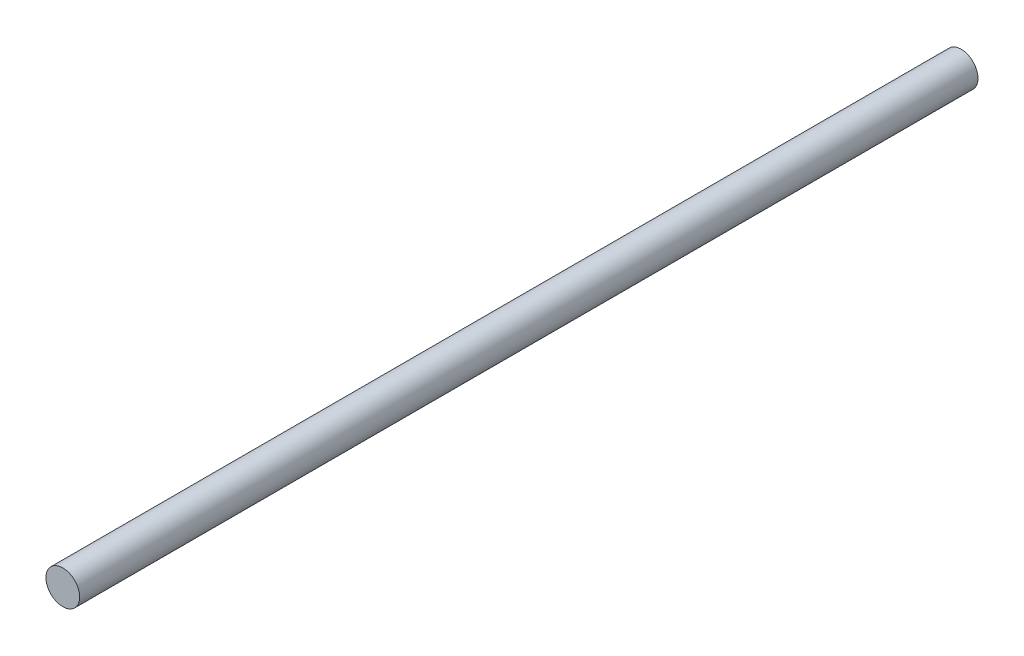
ISO-10303-21;
HEADER;
FILE_DESCRIPTION(('STEP AP214'),'2;1');
FILE_NAME('part.step','',(''),(''),'','','');
FILE_SCHEMA(('AUTOMOTIVE_DESIGN { 1 0 10303 214 1 1 1 1 }'));
ENDSEC;
DATA;
#1=APPLICATION_CONTEXT('core data for automotive mechanical design processes');
#2=APPLICATION_PROTOCOL_DEFINITION('international standard','automotive_design',2000,#1);
#3=PRODUCT_CONTEXT('',#1,'mechanical');
#4=PRODUCT('Part','Part','',(#3));
#5=PRODUCT_RELATED_PRODUCT_CATEGORY('part','',(#4));
#6=PRODUCT_DEFINITION_FORMATION('','',#4);
#7=PRODUCT_DEFINITION_CONTEXT('part definition',#1,'design');
#8=PRODUCT_DEFINITION('design','',#6,#7);
#9=PRODUCT_DEFINITION_SHAPE('','',#8);
#10=(LENGTH_UNIT() NAMED_UNIT(*) SI_UNIT(.MILLI.,.METRE.));
#11=(NAMED_UNIT(*) PLANE_ANGLE_UNIT() SI_UNIT($,.RADIAN.));
#12=(NAMED_UNIT(*) SI_UNIT($,.STERADIAN.) SOLID_ANGLE_UNIT());
#13=UNCERTAINTY_MEASURE_WITH_UNIT(LENGTH_MEASURE(1.E-05),#10,'distance_accuracy_value','');
#14=(GEOMETRIC_REPRESENTATION_CONTEXT(3) GLOBAL_UNCERTAINTY_ASSIGNED_CONTEXT((#13)) GLOBAL_UNIT_ASSIGNED_CONTEXT((#10,
#11,#12)) REPRESENTATION_CONTEXT('',''));
#15=CARTESIAN_POINT('',(0.,0.,0.));
#16=DIRECTION('',(0.,0.,1.));
#17=DIRECTION('',(1.,0.,0.));
#18=AXIS2_PLACEMENT_3D('',#15,#16,#17);
#19=CARTESIAN_POINT('',(0.,0.,320.));
#20=DIRECTION('',(0.,0.,-1.));
#21=DIRECTION('',(-1.,0.,0.));
#22=AXIS2_PLACEMENT_3D('',#19,#20,#21);
#23=CYLINDRICAL_SURFACE('',#22,6.);
#24=CARTESIAN_POINT('',(0.,0.,320.));
#25=DIRECTION('',(0.,0.,1.));
#26=DIRECTION('',(1.,0.,0.));
#27=AXIS2_PLACEMENT_3D('',#24,#25,#26);
#28=CIRCLE('',#27,6.);
#29=CARTESIAN_POINT('',(6.,0.,320.));
#30=VERTEX_POINT('',#29);
#31=EDGE_CURVE('E8',#30,#30,#28,.T.);
#32=ORIENTED_EDGE('',*,*,#31,.F.);
#33=EDGE_LOOP('',(#32));
#34=FACE_BOUND('',#33,.T.);
#35=CARTESIAN_POINT('',(0.,0.,0.));
#36=DIRECTION('',(0.,0.,1.));
#37=DIRECTION('',(1.,0.,0.));
#38=AXIS2_PLACEMENT_3D('',#35,#36,#37);
#39=CIRCLE('',#38,6.);
#40=CARTESIAN_POINT('',(6.,0.,0.));
#41=VERTEX_POINT('',#40);
#42=EDGE_CURVE('E18',#41,#41,#39,.T.);
#43=ORIENTED_EDGE('',*,*,#42,.T.);
#44=EDGE_LOOP('',(#43));
#45=FACE_BOUND('',#44,.T.);
#46=ADVANCED_FACE('F12',(#34,#45),#23,.T.);
#47=CARTESIAN_POINT('',(0.,0.,320.));
#48=DIRECTION('',(0.,0.,1.));
#49=DIRECTION('',(1.,0.,0.));
#50=AXIS2_PLACEMENT_3D('',#47,#48,#49);
#51=PLANE('',#50);
#52=ORIENTED_EDGE('',*,*,#31,.T.);
#53=EDGE_LOOP('',(#52));
#54=FACE_BOUND('',#53,.T.);
#55=ADVANCED_FACE('F27',(#54),#51,.T.);
#56=CARTESIAN_POINT('',(0.,0.,0.));
#57=DIRECTION('',(0.,0.,1.));
#58=DIRECTION('',(1.,0.,0.));
#59=AXIS2_PLACEMENT_3D('',#56,#57,#58);
#60=PLANE('',#59);
#61=ORIENTED_EDGE('',*,*,#42,.F.);
#62=EDGE_LOOP('',(#61));
#63=FACE_BOUND('',#62,.T.);
#64=ADVANCED_FACE('F25',(#63),#60,.F.);
#65=CLOSED_SHELL('',(#46,#55,#64));
#66=MANIFOLD_SOLID_BREP('B1',#65);
#67=ADVANCED_BREP_SHAPE_REPRESENTATION('',(#18,#66),#14);
#68=SHAPE_DEFINITION_REPRESENTATION(#9,#67);
ENDSEC;
END-ISO-10303-21;
